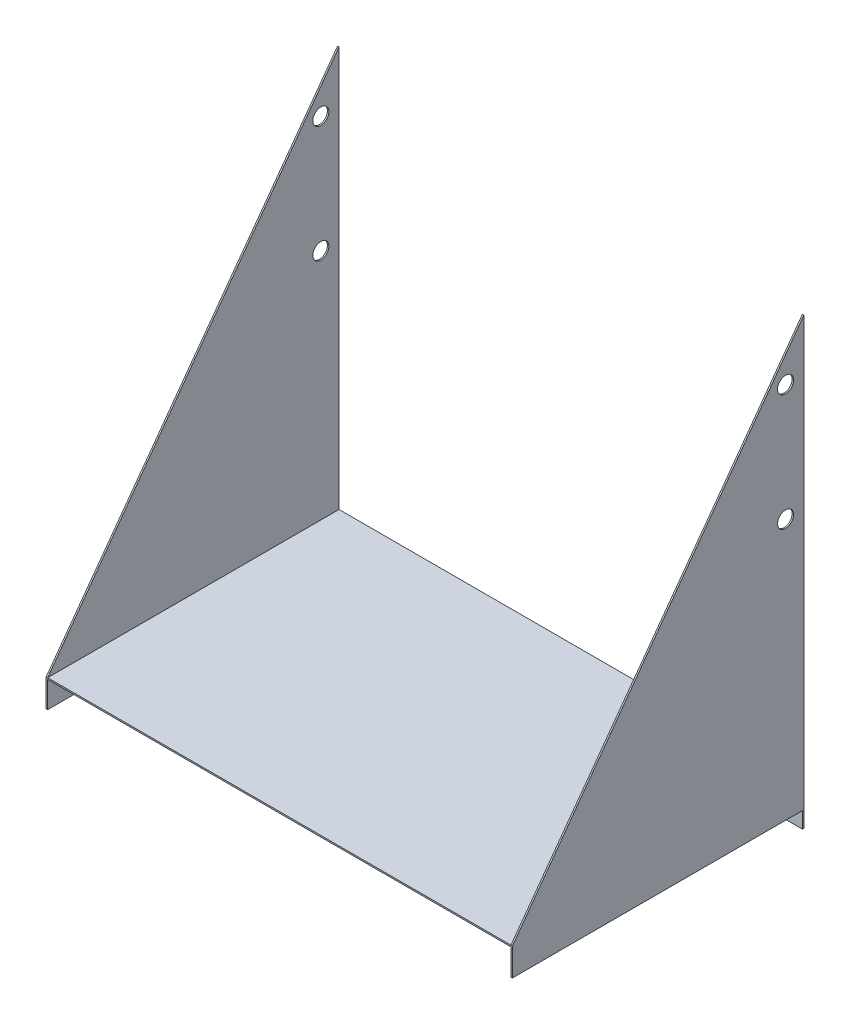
from build123d import *

# Parameters (mm, degrees)
EXTRU_MINCE1_DEPTH      = 200
ESQUISSE2_W             = 200
ESQUISSE2_H             = 19
EXTRUSION1_DEPTH        = 1
ESQUISSE3_W             = 200
ESQUISSE3_H             = 19
EXTRUSION2_DEPTH        = 1
ESQUISSE4_W             = 320
ESQUISSE4_H             = 29
EXTRUSION3_DEPTH        = 1
ESQUISSE5_R             = 5.5
ENL_V_MAT_EXTRU_1_DEPTH = 401
ESQUISSE6_R             = 5.5
ENL_V_MAT_EXTRU_2_DEPTH = 401


with BuildPart() as part:
    # Esquisse1 → Extru.-Mince1 (new body)
    with BuildSketch(Plane.XY):
        Polygon((-52.26514997, -18), (-52.26514997, 0), (265.73485003, 0), (265.73485003, -18), (266.73485003, -18), (266.73485003, 1), (-53.26514997, 1), (-53.26514997, -18), align=None)
    extrude(amount=EXTRU_MINCE1_DEPTH)

    # Esquisse2 → Extrusion1 (add)
    with BuildSketch(Plane(origin=(266.73485003, 0, 0), x_dir=(0, 0, -1), z_dir=(1, 0, 0))):
        Polygon((-200, 1), (0, 1), (0, 276), align=None)
        with Locations((-100, -8.5)):
            Rectangle(ESQUISSE2_W, ESQUISSE2_H)
    extrude(amount=-EXTRUSION1_DEPTH)

    # Esquisse3 → Extrusion2 (add)
    with BuildSketch(Plane.ZY.offset(53.26514997)):
        with Locations((100, -8.5)):
            Rectangle(ESQUISSE3_W, ESQUISSE3_H)
        Polygon((0, 276), (0, 1), (200, 1), align=None)
    extrude(amount=-EXTRUSION2_DEPTH)

    # Esquisse4 → Extrusion3 (add)
    with BuildSketch(Plane(origin=(0, 0, 0), x_dir=(-1, 0, 0), z_dir=(0, 0, -1))):
        with Locations((-106.73485003, -14.5)):
            Rectangle(ESQUISSE4_W, ESQUISSE4_H)
    extrude(amount=-EXTRUSION3_DEPTH)

    # Esquisse5 → Enl_v. mat.-Extru.1 (cut)
    with BuildSketch(Plane(origin=(266.73485003, 0, 0), x_dir=(0, 0, -1), z_dir=(1, 0, 0))):
        with Locations((-12.5, 241)):
            Circle(ESQUISSE5_R)
        with Locations((-12.5, 161)):
            Circle(ESQUISSE5_R)
    extrude(amount=-ENL_V_MAT_EXTRU_1_DEPTH, mode=Mode.SUBTRACT)

    # Esquisse6 → Enl_v. mat.-Extru.2 (cut)
    with BuildSketch(Plane.XY.offset(1)):
        with Locations((-33.26514997, -9)):
            Circle(ESQUISSE6_R)
        with Locations((246.73485003, -9)):
            Circle(ESQUISSE6_R)
    extrude(amount=-ENL_V_MAT_EXTRU_2_DEPTH, mode=Mode.SUBTRACT)


solid = part.part
